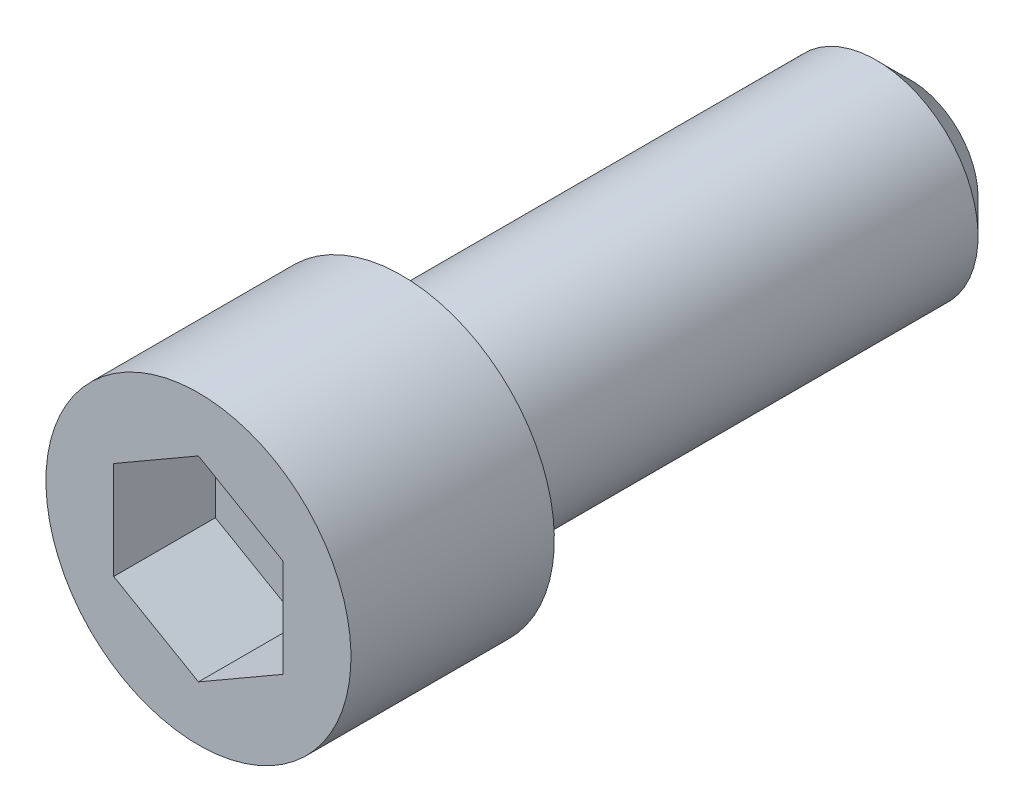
ISO-10303-21;
HEADER;
FILE_DESCRIPTION(('STEP AP214'),'2;1');
FILE_NAME('part.step','',(''),(''),'','','');
FILE_SCHEMA(('AUTOMOTIVE_DESIGN { 1 0 10303 214 1 1 1 1 }'));
ENDSEC;
DATA;
#1=APPLICATION_CONTEXT('core data for automotive mechanical design processes');
#2=APPLICATION_PROTOCOL_DEFINITION('international standard','automotive_design',2000,#1);
#3=PRODUCT_CONTEXT('',#1,'mechanical');
#4=PRODUCT('Part','Part','',(#3));
#5=PRODUCT_RELATED_PRODUCT_CATEGORY('part','',(#4));
#6=PRODUCT_DEFINITION_FORMATION('','',#4);
#7=PRODUCT_DEFINITION_CONTEXT('part definition',#1,'design');
#8=PRODUCT_DEFINITION('design','',#6,#7);
#9=PRODUCT_DEFINITION_SHAPE('','',#8);
#10=(LENGTH_UNIT() NAMED_UNIT(*) SI_UNIT(.MILLI.,.METRE.));
#11=(NAMED_UNIT(*) PLANE_ANGLE_UNIT() SI_UNIT($,.RADIAN.));
#12=(NAMED_UNIT(*) SI_UNIT($,.STERADIAN.) SOLID_ANGLE_UNIT());
#13=UNCERTAINTY_MEASURE_WITH_UNIT(LENGTH_MEASURE(1.E-05),#10,'distance_accuracy_value','');
#14=(GEOMETRIC_REPRESENTATION_CONTEXT(3) GLOBAL_UNCERTAINTY_ASSIGNED_CONTEXT((#13)) GLOBAL_UNIT_ASSIGNED_CONTEXT((#10,
#11,#12)) REPRESENTATION_CONTEXT('',''));
#15=CARTESIAN_POINT('',(0.,0.,0.));
#16=DIRECTION('',(0.,0.,1.));
#17=DIRECTION('',(1.,0.,0.));
#18=AXIS2_PLACEMENT_3D('',#15,#16,#17);
#19=CARTESIAN_POINT('',(0.,0.,12.));
#20=DIRECTION('',(0.,0.,-1.));
#21=DIRECTION('',(0.866025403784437,-0.5,0.));
#22=AXIS2_PLACEMENT_3D('',#19,#20,#21);
#23=PLANE('',#22);
#24=DIRECTION('',(0.866025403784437,-0.5,0.));
#25=VECTOR('',#24,1.);
#26=CARTESIAN_POINT('',(0.,-5.77350269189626,12.));
#27=LINE('',#26,#25);
#28=CARTESIAN_POINT('',(-5.,-2.8867513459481,12.));
#29=VERTEX_POINT('',#28);
#30=CARTESIAN_POINT('',(0.,-5.77350269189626,12.));
#31=VERTEX_POINT('',#30);
#32=EDGE_CURVE('E83',#29,#31,#27,.T.);
#33=ORIENTED_EDGE('',*,*,#32,.F.);
#34=DIRECTION('',(0.,-1.,0.));
#35=VECTOR('',#34,1.);
#36=CARTESIAN_POINT('',(-5.,-2.8867513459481,12.));
#37=LINE('',#36,#35);
#38=CARTESIAN_POINT('',(-5.,2.88675134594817,12.));
#39=VERTEX_POINT('',#38);
#40=EDGE_CURVE('E29',#39,#29,#37,.T.);
#41=ORIENTED_EDGE('',*,*,#40,.F.);
#42=DIRECTION('',(-0.866025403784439,-0.499999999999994,0.));
#43=VECTOR('',#42,1.);
#44=CARTESIAN_POINT('',(0.,5.77350269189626,12.));
#45=LINE('',#44,#43);
#46=CARTESIAN_POINT('',(0.,5.77350269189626,12.));
#47=VERTEX_POINT('',#46);
#48=EDGE_CURVE('E98',#47,#39,#45,.T.);
#49=ORIENTED_EDGE('',*,*,#48,.F.);
#50=DIRECTION('',(-0.866025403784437,0.5,0.));
#51=VECTOR('',#50,1.);
#52=CARTESIAN_POINT('',(5.,2.8867513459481,12.));
#53=LINE('',#52,#51);
#54=CARTESIAN_POINT('',(5.,2.8867513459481,12.));
#55=VERTEX_POINT('',#54);
#56=EDGE_CURVE('E92',#55,#47,#53,.T.);
#57=ORIENTED_EDGE('',*,*,#56,.F.);
#58=DIRECTION('',(0.,1.,0.));
#59=VECTOR('',#58,1.);
#60=CARTESIAN_POINT('',(5.,2.8867513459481,12.));
#61=LINE('',#60,#59);
#62=CARTESIAN_POINT('',(5.,-2.88675134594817,12.));
#63=VERTEX_POINT('',#62);
#64=EDGE_CURVE('E90',#63,#55,#61,.T.);
#65=ORIENTED_EDGE('',*,*,#64,.F.);
#66=DIRECTION('',(0.866025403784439,0.499999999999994,0.));
#67=VECTOR('',#66,1.);
#68=CARTESIAN_POINT('',(0.,-5.77350269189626,12.));
#69=LINE('',#68,#67);
#70=EDGE_CURVE('E72',#31,#63,#69,.T.);
#71=ORIENTED_EDGE('',*,*,#70,.F.);
#72=EDGE_LOOP('',(#33,#41,#49,#57,#65,#71));
#73=FACE_BOUND('',#72,.T.);
#74=CARTESIAN_POINT('',(0.,0.,12.));
#75=DIRECTION('',(0.,0.,-1.));
#76=DIRECTION('',(0.866025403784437,-0.5,0.));
#77=AXIS2_PLACEMENT_3D('',#74,#75,#76);
#78=CIRCLE('',#77,9.);
#79=CARTESIAN_POINT('',(7.79422863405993,-4.5,12.));
#80=VERTEX_POINT('',#79);
#81=EDGE_CURVE('E128',#80,#80,#78,.T.);
#82=ORIENTED_EDGE('',*,*,#81,.F.);
#83=EDGE_LOOP('',(#82));
#84=FACE_BOUND('',#83,.T.);
#85=ADVANCED_FACE('F14',(#73,#84),#23,.F.);
#86=CARTESIAN_POINT('',(0.,0.,0.));
#87=DIRECTION('',(0.,0.,-1.));
#88=DIRECTION('',(0.866025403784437,-0.5,0.));
#89=AXIS2_PLACEMENT_3D('',#86,#87,#88);
#90=CYLINDRICAL_SURFACE('',#89,9.);
#91=CARTESIAN_POINT('',(0.,0.,0.));
#92=DIRECTION('',(0.,0.,-1.));
#93=DIRECTION('',(0.866025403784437,-0.5,0.));
#94=AXIS2_PLACEMENT_3D('',#91,#92,#93);
#95=CIRCLE('',#94,9.);
#96=CARTESIAN_POINT('',(7.79422863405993,-4.5,0.));
#97=VERTEX_POINT('',#96);
#98=EDGE_CURVE('E125',#97,#97,#95,.T.);
#99=ORIENTED_EDGE('',*,*,#98,.F.);
#100=EDGE_LOOP('',(#99));
#101=FACE_BOUND('',#100,.T.);
#102=ORIENTED_EDGE('',*,*,#81,.T.);
#103=EDGE_LOOP('',(#102));
#104=FACE_BOUND('',#103,.T.);
#105=ADVANCED_FACE('F147',(#101,#104),#90,.T.);
#106=CARTESIAN_POINT('',(-4.5,-7.79422863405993,0.));
#107=DIRECTION('',(0.,0.,1.));
#108=DIRECTION('',(-0.866025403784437,0.5,0.));
#109=AXIS2_PLACEMENT_3D('',#106,#107,#108);
#110=PLANE('',#109);
#111=CARTESIAN_POINT('',(0.,0.,0.));
#112=DIRECTION('',(0.,0.,-1.));
#113=DIRECTION('',(0.866025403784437,-0.5,0.));
#114=AXIS2_PLACEMENT_3D('',#111,#112,#113);
#115=CIRCLE('',#114,6.);
#116=CARTESIAN_POINT('',(5.19615242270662,-3.,0.));
#117=VERTEX_POINT('',#116);
#118=EDGE_CURVE('E116',#117,#117,#115,.T.);
#119=ORIENTED_EDGE('',*,*,#118,.F.);
#120=EDGE_LOOP('',(#119));
#121=FACE_BOUND('',#120,.T.);
#122=ORIENTED_EDGE('',*,*,#98,.T.);
#123=EDGE_LOOP('',(#122));
#124=FACE_BOUND('',#123,.T.);
#125=ADVANCED_FACE('F152',(#121,#124),#110,.F.);
#126=CARTESIAN_POINT('',(0.,0.,0.));
#127=DIRECTION('',(0.,0.,-1.));
#128=DIRECTION('',(0.866025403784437,-0.5,0.));
#129=AXIS2_PLACEMENT_3D('',#126,#127,#128);
#130=CYLINDRICAL_SURFACE('',#129,6.);
#131=CARTESIAN_POINT('',(0.,0.,-28.));
#132=DIRECTION('',(0.,0.,1.));
#133=DIRECTION('',(-0.866025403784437,0.5,0.));
#134=AXIS2_PLACEMENT_3D('',#131,#132,#133);
#135=CIRCLE('',#134,6.);
#136=CARTESIAN_POINT('',(-5.19615242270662,3.,-28.));
#137=VERTEX_POINT('',#136);
#138=EDGE_CURVE('E9',#137,#137,#135,.T.);
#139=ORIENTED_EDGE('',*,*,#138,.T.);
#140=EDGE_LOOP('',(#139));
#141=FACE_BOUND('',#140,.T.);
#142=ORIENTED_EDGE('',*,*,#118,.T.);
#143=EDGE_LOOP('',(#142));
#144=FACE_BOUND('',#143,.T.);
#145=ADVANCED_FACE('F158',(#141,#144),#130,.T.);
#146=CARTESIAN_POINT('',(-3.,-5.19615242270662,-30.));
#147=DIRECTION('',(0.,0.,1.));
#148=DIRECTION('',(-0.866025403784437,0.5,0.));
#149=AXIS2_PLACEMENT_3D('',#146,#147,#148);
#150=PLANE('',#149);
#151=CARTESIAN_POINT('',(0.,0.,-30.));
#152=DIRECTION('',(0.,0.,1.));
#153=DIRECTION('',(-0.866025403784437,0.5,0.));
#154=AXIS2_PLACEMENT_3D('',#151,#152,#153);
#155=CIRCLE('',#154,4.);
#156=CARTESIAN_POINT('',(-3.46410161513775,2.,-30.));
#157=VERTEX_POINT('',#156);
#158=EDGE_CURVE('E22',#157,#157,#155,.F.);
#159=ORIENTED_EDGE('',*,*,#158,.T.);
#160=EDGE_LOOP('',(#159));
#161=FACE_BOUND('',#160,.T.);
#162=ADVANCED_FACE('F133',(#161),#150,.F.);
#163=CARTESIAN_POINT('',(-5.,-2.8867513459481,6.));
#164=DIRECTION('',(-1.,0.,0.));
#165=DIRECTION('',(0.,-1.,0.));
#166=AXIS2_PLACEMENT_3D('',#163,#164,#165);
#167=PLANE('',#166);
#168=ORIENTED_EDGE('',*,*,#40,.T.);
#169=DIRECTION('',(0.,0.,1.));
#170=VECTOR('',#169,1.);
#171=CARTESIAN_POINT('',(-5.,-2.8867513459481,6.));
#172=LINE('',#171,#170);
#173=CARTESIAN_POINT('',(-5.,-2.8867513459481,6.));
#174=VERTEX_POINT('',#173);
#175=EDGE_CURVE('E80',#174,#29,#172,.T.);
#176=ORIENTED_EDGE('',*,*,#175,.F.);
#177=DIRECTION('',(0.,-1.,0.));
#178=VECTOR('',#177,1.);
#179=CARTESIAN_POINT('',(-5.,-2.8867513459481,6.));
#180=LINE('',#179,#178);
#181=CARTESIAN_POINT('',(-5.,2.88675134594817,6.));
#182=VERTEX_POINT('',#181);
#183=EDGE_CURVE('E100',#182,#174,#180,.T.);
#184=ORIENTED_EDGE('',*,*,#183,.F.);
#185=DIRECTION('',(0.,0.,1.));
#186=VECTOR('',#185,1.);
#187=CARTESIAN_POINT('',(-5.,2.88675134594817,6.));
#188=LINE('',#187,#186);
#189=EDGE_CURVE('E36',#182,#39,#188,.T.);
#190=ORIENTED_EDGE('',*,*,#189,.T.);
#191=EDGE_LOOP('',(#168,#176,#184,#190));
#192=FACE_BOUND('',#191,.T.);
#193=ADVANCED_FACE('F165',(#192),#167,.F.);
#194=CARTESIAN_POINT('',(0.,5.77350269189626,6.));
#195=DIRECTION('',(-0.499999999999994,0.866025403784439,0.));
#196=DIRECTION('',(-0.86602540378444,-0.5,0.));
#197=AXIS2_PLACEMENT_3D('',#194,#195,#196);
#198=PLANE('',#197);
#199=ORIENTED_EDGE('',*,*,#48,.T.);
#200=ORIENTED_EDGE('',*,*,#189,.F.);
#201=DIRECTION('',(-0.866025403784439,-0.499999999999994,0.));
#202=VECTOR('',#201,1.);
#203=CARTESIAN_POINT('',(0.,5.77350269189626,6.));
#204=LINE('',#203,#202);
#205=CARTESIAN_POINT('',(0.,5.77350269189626,6.));
#206=VERTEX_POINT('',#205);
#207=EDGE_CURVE('E112',#206,#182,#204,.T.);
#208=ORIENTED_EDGE('',*,*,#207,.F.);
#209=DIRECTION('',(0.,0.,1.));
#210=VECTOR('',#209,1.);
#211=CARTESIAN_POINT('',(0.,5.77350269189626,6.));
#212=LINE('',#211,#210);
#213=EDGE_CURVE('E117',#206,#47,#212,.T.);
#214=ORIENTED_EDGE('',*,*,#213,.T.);
#215=EDGE_LOOP('',(#199,#200,#208,#214));
#216=FACE_BOUND('',#215,.T.);
#217=ADVANCED_FACE('F168',(#216),#198,.F.);
#218=CARTESIAN_POINT('',(5.,2.8867513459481,6.));
#219=DIRECTION('',(0.5,0.866025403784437,0.));
#220=DIRECTION('',(0.,0.,-1.));
#221=AXIS2_PLACEMENT_3D('',#218,#219,#220);
#222=PLANE('',#221);
#223=ORIENTED_EDGE('',*,*,#56,.T.);
#224=ORIENTED_EDGE('',*,*,#213,.F.);
#225=DIRECTION('',(-0.866025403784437,0.5,0.));
#226=VECTOR('',#225,1.);
#227=CARTESIAN_POINT('',(5.,2.8867513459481,6.));
#228=LINE('',#227,#226);
#229=CARTESIAN_POINT('',(5.,2.8867513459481,6.));
#230=VERTEX_POINT('',#229);
#231=EDGE_CURVE('E109',#230,#206,#228,.T.);
#232=ORIENTED_EDGE('',*,*,#231,.F.);
#233=DIRECTION('',(0.,0.,1.));
#234=VECTOR('',#233,1.);
#235=CARTESIAN_POINT('',(5.,2.8867513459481,6.));
#236=LINE('',#235,#234);
#237=EDGE_CURVE('E119',#230,#55,#236,.T.);
#238=ORIENTED_EDGE('',*,*,#237,.T.);
#239=EDGE_LOOP('',(#223,#224,#232,#238));
#240=FACE_BOUND('',#239,.T.);
#241=ADVANCED_FACE('F176',(#240),#222,.F.);
#242=CARTESIAN_POINT('',(5.,2.8867513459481,6.));
#243=DIRECTION('',(1.,0.,0.));
#244=DIRECTION('',(0.,1.,0.));
#245=AXIS2_PLACEMENT_3D('',#242,#243,#244);
#246=PLANE('',#245);
#247=ORIENTED_EDGE('',*,*,#64,.T.);
#248=ORIENTED_EDGE('',*,*,#237,.F.);
#249=DIRECTION('',(0.,1.,0.));
#250=VECTOR('',#249,1.);
#251=CARTESIAN_POINT('',(5.,2.8867513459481,6.));
#252=LINE('',#251,#250);
#253=CARTESIAN_POINT('',(5.,-2.88675134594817,6.));
#254=VERTEX_POINT('',#253);
#255=EDGE_CURVE('E106',#254,#230,#252,.T.);
#256=ORIENTED_EDGE('',*,*,#255,.F.);
#257=DIRECTION('',(0.,0.,1.));
#258=VECTOR('',#257,1.);
#259=CARTESIAN_POINT('',(5.,-2.88675134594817,6.));
#260=LINE('',#259,#258);
#261=EDGE_CURVE('E79',#254,#63,#260,.T.);
#262=ORIENTED_EDGE('',*,*,#261,.T.);
#263=EDGE_LOOP('',(#247,#248,#256,#262));
#264=FACE_BOUND('',#263,.T.);
#265=ADVANCED_FACE('F173',(#264),#246,.F.);
#266=CARTESIAN_POINT('',(0.,-5.77350269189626,6.));
#267=DIRECTION('',(0.499999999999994,-0.866025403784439,0.));
#268=DIRECTION('',(0.86602540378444,0.5,0.));
#269=AXIS2_PLACEMENT_3D('',#266,#267,#268);
#270=PLANE('',#269);
#271=ORIENTED_EDGE('',*,*,#70,.T.);
#272=ORIENTED_EDGE('',*,*,#261,.F.);
#273=DIRECTION('',(0.866025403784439,0.499999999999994,0.));
#274=VECTOR('',#273,1.);
#275=CARTESIAN_POINT('',(0.,-5.77350269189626,6.));
#276=LINE('',#275,#274);
#277=CARTESIAN_POINT('',(0.,-5.77350269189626,6.));
#278=VERTEX_POINT('',#277);
#279=EDGE_CURVE('E75',#278,#254,#276,.T.);
#280=ORIENTED_EDGE('',*,*,#279,.F.);
#281=DIRECTION('',(0.,0.,1.));
#282=VECTOR('',#281,1.);
#283=CARTESIAN_POINT('',(0.,-5.77350269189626,6.));
#284=LINE('',#283,#282);
#285=EDGE_CURVE('E68',#278,#31,#284,.T.);
#286=ORIENTED_EDGE('',*,*,#285,.T.);
#287=EDGE_LOOP('',(#271,#272,#280,#286));
#288=FACE_BOUND('',#287,.T.);
#289=ADVANCED_FACE('F70',(#288),#270,.F.);
#290=CARTESIAN_POINT('',(0.,-5.77350269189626,6.));
#291=DIRECTION('',(-0.5,-0.866025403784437,0.));
#292=DIRECTION('',(0.,0.,1.));
#293=AXIS2_PLACEMENT_3D('',#290,#291,#292);
#294=PLANE('',#293);
#295=ORIENTED_EDGE('',*,*,#32,.T.);
#296=ORIENTED_EDGE('',*,*,#285,.F.);
#297=DIRECTION('',(0.866025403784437,-0.5,0.));
#298=VECTOR('',#297,1.);
#299=CARTESIAN_POINT('',(0.,-5.77350269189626,6.));
#300=LINE('',#299,#298);
#301=EDGE_CURVE('E103',#174,#278,#300,.T.);
#302=ORIENTED_EDGE('',*,*,#301,.F.);
#303=ORIENTED_EDGE('',*,*,#175,.T.);
#304=EDGE_LOOP('',(#295,#296,#302,#303));
#305=FACE_BOUND('',#304,.T.);
#306=ADVANCED_FACE('F84',(#305),#294,.F.);
#307=CARTESIAN_POINT('',(-5.,2.88675134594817,6.));
#308=DIRECTION('',(0.,0.,1.));
#309=DIRECTION('',(-0.866025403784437,0.5,0.));
#310=AXIS2_PLACEMENT_3D('',#307,#308,#309);
#311=PLANE('',#310);
#312=ORIENTED_EDGE('',*,*,#183,.T.);
#313=ORIENTED_EDGE('',*,*,#301,.T.);
#314=ORIENTED_EDGE('',*,*,#279,.T.);
#315=ORIENTED_EDGE('',*,*,#255,.T.);
#316=ORIENTED_EDGE('',*,*,#231,.T.);
#317=ORIENTED_EDGE('',*,*,#207,.T.);
#318=EDGE_LOOP('',(#312,#313,#314,#315,#316,#317));
#319=FACE_BOUND('',#318,.T.);
#320=ADVANCED_FACE('F136',(#319),#311,.T.);
#321=CARTESIAN_POINT('',(0.,0.,-30.));
#322=DIRECTION('',(0.,0.,1.));
#323=DIRECTION('',(-0.866025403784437,0.5,0.));
#324=AXIS2_PLACEMENT_3D('',#321,#322,#323);
#325=CONICAL_SURFACE('',#324,4.,0.785398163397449);
#326=ORIENTED_EDGE('',*,*,#138,.F.);
#327=EDGE_LOOP('',(#326));
#328=FACE_BOUND('',#327,.T.);
#329=ORIENTED_EDGE('',*,*,#158,.F.);
#330=EDGE_LOOP('',(#329));
#331=FACE_BOUND('',#330,.T.);
#332=ADVANCED_FACE('F16',(#328,#331),#325,.T.);
#333=CLOSED_SHELL('',(#85,#105,#125,#145,#162,#193,#217,#241,#265,#289,#306,#320,#332));
#334=MANIFOLD_SOLID_BREP('B1',#333);
#335=ADVANCED_BREP_SHAPE_REPRESENTATION('',(#18,#334),#14);
#336=SHAPE_DEFINITION_REPRESENTATION(#9,#335);
ENDSEC;
END-ISO-10303-21;
